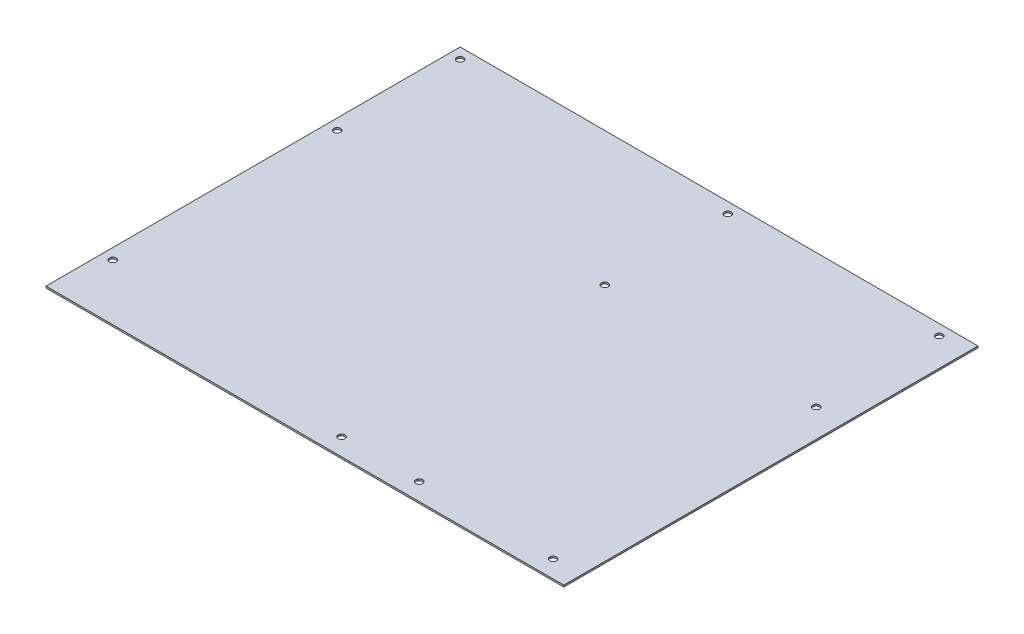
from build123d import *

# Parameters (mm, degrees)
SKETCH1_W           = 304.8
SKETCH1_H           = 243.8
BOSS_EXTRUDE1_DEPTH = 1
SKETCH2_R           = 2
CUT_EXTRUDE1_DEPTH  = 1


with BuildPart() as part:
    # Sketch1 → Boss-Extrude1 (new body)
    with BuildSketch(Plane(origin=(0, 0, 0), x_dir=(1, 0, 0), z_dir=(0, 1, 0))):
        with Locations((-152.4, 121.9)):
            Rectangle(SKETCH1_W, SKETCH1_H)
    extrude(amount=BOSS_EXTRUDE1_DEPTH)

    # Sketch2 → Cut-Extrude1 (cut)
    with BuildSketch(Plane(origin=(0, 1, 0), x_dir=(1, 0, 0), z_dir=(0, 1, 0))):
        with Locations(Location((-16.5, 237.5, 0), (0, 0, 270))):
            Circle(SKETCH2_R)
        with Locations(Location((-16.5, 165.1, 0), (0, 0, 270))):
            Circle(SKETCH2_R)
        with Locations(Location((-16.5, 10.2, 0), (0, 0, 270))):
            Circle(SKETCH2_R)
        with Locations(Location((-298.5, 165.1, 0), (0, 0, 270))):
            Circle(SKETCH2_R)
        with Locations(Location((-298.5, 237.5, 0), (0, 0, 270))):
            Circle(SKETCH2_R)
        with Locations(Location((-141, 237.5, 0), (0, 0, 270))):
            Circle(SKETCH2_R)
        with Locations(Location((-141, 165.1, 0), (0, 0, 270))):
            Circle(SKETCH2_R)
        with Locations(Location((-141, 10.2, 0), (0, 0, 270))):
            Circle(SKETCH2_R)
        with Locations(Location((-95.3, 10.2, 0), (0, 0, 270))):
            Circle(SKETCH2_R)
        with Locations(Location((-298.5, 33, 0), (0, 0, 270))):
            Circle(SKETCH2_R)
    extrude(amount=-CUT_EXTRUDE1_DEPTH, mode=Mode.SUBTRACT)


solid = part.part
